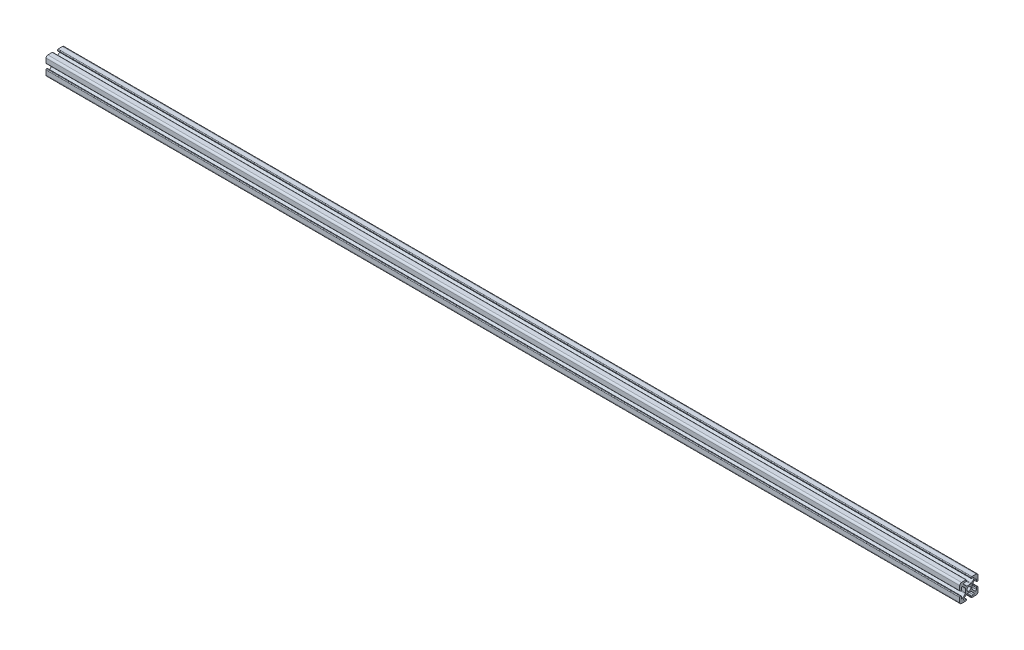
from build123d import *

# Parameters (mm, degrees)
MODEL_R                = 2.15
STRUKTURBAUTEIL1_DEPTH = 1000


with BuildPart() as part:
    # Model → Strukturbauteil1 (new body)
    with BuildSketch(Plane(origin=(0, 0, 0), x_dir=(0, 0, -1), z_dir=(1, 0, 0))):
        with BuildLine():
            Line((-8.7, -2.5), (-9.3, -2.5))
            ThreePointArc((-9.3, -2.5), (-9.794974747, -2.705025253), (-10, -3.2))
            Line((-10, -3.2), (-10, -8))
            ThreePointArc((-10, -8), (-9.414213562, -9.414213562), (-8, -10))
            Line((-8, -10), (-3.2, -10))
            ThreePointArc((-3.2, -10), (-2.705025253, -9.794974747), (-2.5, -9.3))
            Line((-2.5, -9.3), (-2.5, -8.7))
            ThreePointArc((-2.5, -8.7), (-2.646446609, -8.346446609), (-3, -8.2))
            Line((-3, -8.2), (-4.867588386, -8.2))
            ThreePointArc((-4.867588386, -8.2), (-5.682830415, -7.655272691), (-5.491547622, -6.69362915))
            Line((-5.491547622, -6.69362915), (-2.740811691, -3.942893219))
            ThreePointArc((-2.740811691, -3.942893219), (-2.416388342, -3.726120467), (-2.03370491, -3.65))
            Line((-2.03370491, -3.65), (2.03370491, -3.65))
            ThreePointArc((2.03370491, -3.65), (2.416388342, -3.726120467), (2.740811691, -3.942893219))
            Line((2.740811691, -3.942893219), (5.491547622, -6.69362915))
            ThreePointArc((5.491547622, -6.69362915), (5.682830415, -7.655272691), (4.867588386, -8.2))
            Line((4.867588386, -8.2), (3, -8.2))
            ThreePointArc((3, -8.2), (2.646446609, -8.346446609), (2.5, -8.7))
            Line((2.5, -8.7), (2.5, -9.3))
            ThreePointArc((2.5, -9.3), (2.705025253, -9.794974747), (3.2, -10))
            Line((3.2, -10), (8, -10))
            ThreePointArc((8, -10), (9.414213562, -9.414213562), (10, -8))
            Line((10, -8), (10, -3.2))
            ThreePointArc((10, -3.2), (9.794974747, -2.705025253), (9.3, -2.5))
            Line((9.3, -2.5), (8.7, -2.5))
            ThreePointArc((8.7, -2.5), (8.346446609, -2.646446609), (8.2, -3))
            Line((8.2, -3), (8.2, -4.867588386))
            ThreePointArc((8.2, -4.867588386), (7.655272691, -5.682830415), (6.69362915, -5.491547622))
            Line((6.69362915, -5.491547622), (3.942893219, -2.740811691))
            ThreePointArc((3.942893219, -2.740811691), (3.726120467, -2.416388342), (3.65, -2.03370491))
            Line((3.65, -2.03370491), (3.65, 2.03370491))
            ThreePointArc((3.65, 2.03370491), (3.726120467, 2.416388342), (3.942893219, 2.740811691))
            Line((3.942893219, 2.740811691), (6.69362915, 5.491547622))
            ThreePointArc((6.69362915, 5.491547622), (7.655272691, 5.682830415), (8.2, 4.867588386))
            Line((8.2, 4.867588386), (8.2, 3))
            ThreePointArc((8.2, 3), (8.346446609, 2.646446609), (8.7, 2.5))
            Line((8.7, 2.5), (9.3, 2.5))
            ThreePointArc((9.3, 2.5), (9.794974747, 2.705025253), (10, 3.2))
            Line((10, 3.2), (10, 8))
            ThreePointArc((10, 8), (9.414213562, 9.414213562), (8, 10))
            Line((8, 10), (3.2, 10))
            ThreePointArc((3.2, 10), (2.705025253, 9.794974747), (2.5, 9.3))
            Line((2.5, 9.3), (2.5, 8.7))
            ThreePointArc((2.5, 8.7), (2.646446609, 8.346446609), (3, 8.2))
            Line((3, 8.2), (4.867588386, 8.2))
            ThreePointArc((4.867588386, 8.2), (5.682830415, 7.655272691), (5.491547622, 6.69362915))
            Line((5.491547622, 6.69362915), (2.740811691, 3.942893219))
            ThreePointArc((2.740811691, 3.942893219), (2.416388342, 3.726120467), (2.03370491, 3.65))
            Line((2.03370491, 3.65), (-2.03370491, 3.65))
            ThreePointArc((-2.03370491, 3.65), (-2.416388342, 3.726120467), (-2.740811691, 3.942893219))
            Line((-2.740811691, 3.942893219), (-5.491547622, 6.69362915))
            ThreePointArc((-5.491547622, 6.69362915), (-5.682830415, 7.655272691), (-4.867588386, 8.2))
            Line((-4.867588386, 8.2), (-3, 8.2))
            ThreePointArc((-3, 8.2), (-2.646446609, 8.346446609), (-2.5, 8.7))
            Line((-2.5, 8.7), (-2.5, 9.3))
            ThreePointArc((-2.5, 9.3), (-2.705025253, 9.794974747), (-3.2, 10))
            Line((-3.2, 10), (-8, 10))
            ThreePointArc((-8, 10), (-9.414213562, 9.414213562), (-10, 8))
            Line((-10, 8), (-10, 3.2))
            ThreePointArc((-10, 3.2), (-9.794974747, 2.705025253), (-9.3, 2.5))
            Line((-9.3, 2.5), (-8.7, 2.5))
            ThreePointArc((-8.7, 2.5), (-8.346446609, 2.646446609), (-8.2, 3))
            Line((-8.2, 3), (-8.2, 4.867588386))
            ThreePointArc((-8.2, 4.867588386), (-7.655272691, 5.682830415), (-6.69362915, 5.491547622))
            Line((-6.69362915, 5.491547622), (-3.942893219, 2.740811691))
            ThreePointArc((-3.942893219, 2.740811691), (-3.726120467, 2.416388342), (-3.65, 2.03370491))
            Line((-3.65, 2.03370491), (-3.65, -2.03370491))
            ThreePointArc((-3.65, -2.03370491), (-3.726120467, -2.416388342), (-3.942893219, -2.740811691))
            Line((-3.942893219, -2.740811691), (-6.69362915, -5.491547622))
            ThreePointArc((-6.69362915, -5.491547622), (-7.655272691, -5.682830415), (-8.2, -4.867588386))
            Line((-8.2, -4.867588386), (-8.2, -3))
            ThreePointArc((-8.2, -3), (-8.346446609, -2.646446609), (-8.7, -2.5))
        make_face()
        Circle(MODEL_R, mode=Mode.SUBTRACT)
    extrude(amount=STRUKTURBAUTEIL1_DEPTH)


solid = part.part
